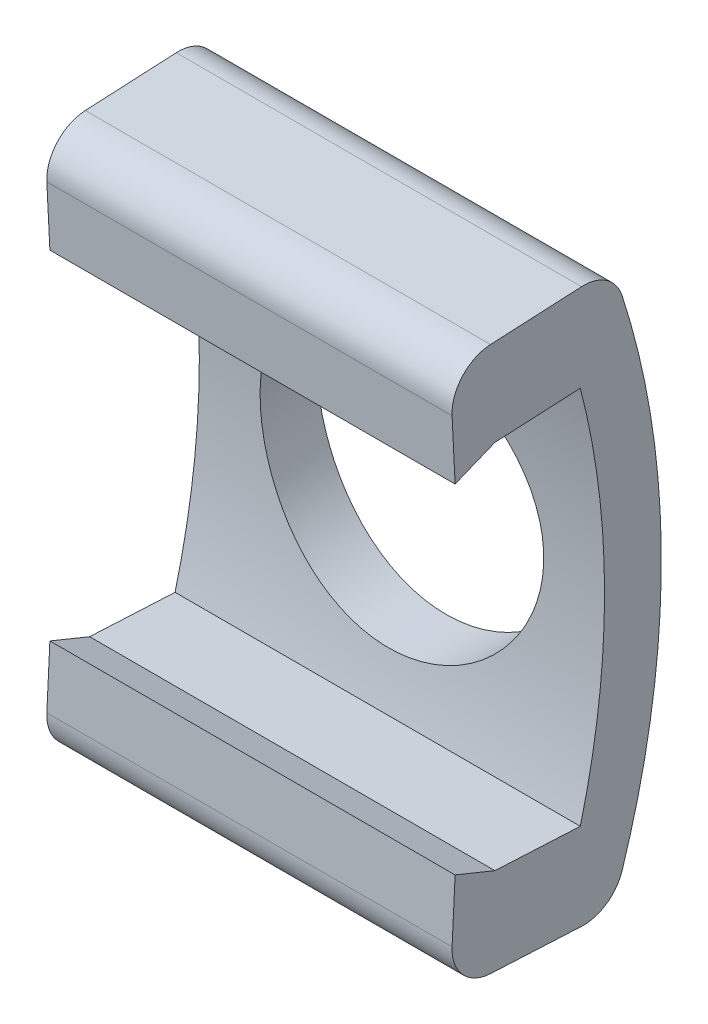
ISO-10303-21;
HEADER;
FILE_DESCRIPTION(('STEP AP214'),'2;1');
FILE_NAME('part.step','',(''),(''),'','','');
FILE_SCHEMA(('AUTOMOTIVE_DESIGN { 1 0 10303 214 1 1 1 1 }'));
ENDSEC;
DATA;
#1=APPLICATION_CONTEXT('core data for automotive mechanical design processes');
#2=APPLICATION_PROTOCOL_DEFINITION('international standard','automotive_design',2000,#1);
#3=PRODUCT_CONTEXT('',#1,'mechanical');
#4=PRODUCT('Part','Part','',(#3));
#5=PRODUCT_RELATED_PRODUCT_CATEGORY('part','',(#4));
#6=PRODUCT_DEFINITION_FORMATION('','',#4);
#7=PRODUCT_DEFINITION_CONTEXT('part definition',#1,'design');
#8=PRODUCT_DEFINITION('design','',#6,#7);
#9=PRODUCT_DEFINITION_SHAPE('','',#8);
#10=(LENGTH_UNIT() NAMED_UNIT(*) SI_UNIT(.MILLI.,.METRE.));
#11=(NAMED_UNIT(*) PLANE_ANGLE_UNIT() SI_UNIT($,.RADIAN.));
#12=(NAMED_UNIT(*) SI_UNIT($,.STERADIAN.) SOLID_ANGLE_UNIT());
#13=UNCERTAINTY_MEASURE_WITH_UNIT(LENGTH_MEASURE(1.E-05),#10,'distance_accuracy_value','');
#14=(GEOMETRIC_REPRESENTATION_CONTEXT(3) GLOBAL_UNCERTAINTY_ASSIGNED_CONTEXT((#13)) GLOBAL_UNIT_ASSIGNED_CONTEXT((#10,
#11,#12)) REPRESENTATION_CONTEXT('',''));
#15=CARTESIAN_POINT('',(0.,0.,0.));
#16=DIRECTION('',(0.,0.,1.));
#17=DIRECTION('',(1.,0.,0.));
#18=AXIS2_PLACEMENT_3D('',#15,#16,#17);
#19=CARTESIAN_POINT('',(5.,0.,20.));
#20=DIRECTION('',(-1.,0.,0.));
#21=DIRECTION('',(0.,0.,1.));
#22=AXIS2_PLACEMENT_3D('',#19,#20,#21);
#23=CYLINDRICAL_SURFACE('',#22,18.6);
#24=CARTESIAN_POINT('',(-5.,0.,20.));
#25=DIRECTION('',(-1.,0.,0.));
#26=DIRECTION('',(0.,0.,-1.));
#27=AXIS2_PLACEMENT_3D('',#24,#25,#26);
#28=CIRCLE('',#27,18.6);
#29=CARTESIAN_POINT('',(-5.,4.68126724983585,1.99872957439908));
#30=VERTEX_POINT('',#29);
#31=CARTESIAN_POINT('',(-5.,-4.68126724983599,1.99872957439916));
#32=VERTEX_POINT('',#31);
#33=EDGE_CURVE('E188',#30,#32,#28,.T.);
#34=ORIENTED_EDGE('',*,*,#33,.T.);
#35=DIRECTION('',(-1.,0.,0.));
#36=VECTOR('',#35,1.);
#37=CARTESIAN_POINT('',(5.,-4.68126724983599,1.99872957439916));
#38=LINE('',#37,#36);
#39=CARTESIAN_POINT('',(5.,-4.68126724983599,1.99872957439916));
#40=VERTEX_POINT('',#39);
#41=EDGE_CURVE('E243',#40,#32,#38,.T.);
#42=ORIENTED_EDGE('',*,*,#41,.F.);
#43=CARTESIAN_POINT('',(5.,0.,20.));
#44=DIRECTION('',(-1.,0.,0.));
#45=DIRECTION('',(0.,0.,-1.));
#46=AXIS2_PLACEMENT_3D('',#43,#44,#45);
#47=CIRCLE('',#46,18.6);
#48=CARTESIAN_POINT('',(5.,4.68126724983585,1.99872957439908));
#49=VERTEX_POINT('',#48);
#50=EDGE_CURVE('E268',#49,#40,#47,.T.);
#51=ORIENTED_EDGE('',*,*,#50,.F.);
#52=DIRECTION('',(-1.,0.,0.));
#53=VECTOR('',#52,1.);
#54=CARTESIAN_POINT('',(5.,4.68126724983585,1.99872957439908));
#55=LINE('',#54,#53);
#56=EDGE_CURVE('E246',#49,#30,#55,.T.);
#57=ORIENTED_EDGE('',*,*,#56,.T.);
#58=EDGE_LOOP('',(#34,#42,#51,#57));
#59=FACE_BOUND('',#58,.T.);
#60=CARTESIAN_POINT('',(-3.5,0.,1.40000000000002));
#61=CARTESIAN_POINT('',(-3.49999257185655,-0.194754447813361,1.40000353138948));
#62=CARTESIAN_POINT('',(-3.48368965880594,-0.389605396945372,1.40309038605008));
#63=CARTESIAN_POINT('',(-3.41895125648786,-0.773815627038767,1.41510691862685));
#64=CARTESIAN_POINT('',(-3.37048873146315,-0.963170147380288,1.42404151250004));
#65=CARTESIAN_POINT('',(-3.24296825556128,-1.33077552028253,1.44675416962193));
#66=CARTESIAN_POINT('',(-3.16393802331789,-1.5090362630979,1.4605278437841));
#67=CARTESIAN_POINT('',(-2.9776043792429,-1.84975174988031,1.49141494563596));
#68=CARTESIAN_POINT('',(-2.87030322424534,-2.01220775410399,1.50852810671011));
#69=CARTESIAN_POINT('',(-2.62910031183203,-2.31867726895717,1.54443630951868));
#70=CARTESIAN_POINT('',(-2.4949237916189,-2.46247265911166,1.56324751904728));
#71=CARTESIAN_POINT('',(-2.20436995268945,-2.72565207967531,1.60031180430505));
#72=CARTESIAN_POINT('',(-2.04799103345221,-2.84503434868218,1.61856483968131));
#73=CARTESIAN_POINT('',(-1.71592852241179,-3.05690702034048,1.65260330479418));
#74=CARTESIAN_POINT('',(-1.54010090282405,-3.14917533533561,1.66836789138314));
#75=CARTESIAN_POINT('',(-1.17509395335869,-3.30277916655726,1.69541664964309));
#76=CARTESIAN_POINT('',(-0.985915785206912,-3.36411737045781,1.70670121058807));
#77=CARTESIAN_POINT('',(-0.601912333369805,-3.45341937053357,1.72334947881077));
#78=CARTESIAN_POINT('',(-0.407178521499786,-3.48176367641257,1.72878063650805));
#79=CARTESIAN_POINT('',(-0.0156493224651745,-3.50545441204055,1.73331050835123));
#80=CARTESIAN_POINT('',(0.18114587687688,-3.50080382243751,1.7324097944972));
#81=CARTESIAN_POINT('',(0.568453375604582,-3.4589452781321,1.72443909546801));
#82=CARTESIAN_POINT('',(0.759014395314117,-3.42217019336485,1.71745113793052));
#83=CARTESIAN_POINT('',(1.13121277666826,-3.31778835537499,1.69822217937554));
#84=CARTESIAN_POINT('',(1.31284975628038,-3.25018028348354,1.68598095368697));
#85=CARTESIAN_POINT('',(1.66330960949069,-3.08562880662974,1.65753908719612));
#86=CARTESIAN_POINT('',(1.83204851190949,-2.98851078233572,1.64131499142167));
#87=CARTESIAN_POINT('',(2.1509979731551,-2.76781970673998,1.6067509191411));
#88=CARTESIAN_POINT('',(2.30120663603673,-2.64424395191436,1.58841072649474));
#89=CARTESIAN_POINT('',(2.58133257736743,-2.37181228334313,1.55132363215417));
#90=CARTESIAN_POINT('',(2.71088984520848,-2.22258616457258,1.53257489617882));
#91=CARTESIAN_POINT('',(2.94318645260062,-1.90432808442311,1.49705076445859));
#92=CARTESIAN_POINT('',(3.04592551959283,-1.73529592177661,1.48027538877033));
#93=CARTESIAN_POINT('',(3.22172309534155,-1.38184714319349,1.45055387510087));
#94=CARTESIAN_POINT('',(3.29474396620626,-1.19741137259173,1.43761259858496));
#95=CARTESIAN_POINT('',(3.40866732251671,-0.818593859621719,1.41705495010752));
#96=CARTESIAN_POINT('',(3.4495732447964,-0.624213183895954,1.40943800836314));
#97=CARTESIAN_POINT('',(3.49760398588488,-0.234120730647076,1.4004655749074));
#98=CARTESIAN_POINT('',(3.50522204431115,-0.0384717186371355,1.39901866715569));
#99=CARTESIAN_POINT('',(3.4877841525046,0.351304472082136,1.40229673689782));
#100=CARTESIAN_POINT('',(3.46272981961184,0.545431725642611,1.40702140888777));
#101=CARTESIAN_POINT('',(3.38106840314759,0.925087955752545,1.42205482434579));
#102=CARTESIAN_POINT('',(3.32471108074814,1.11067255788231,1.43231934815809));
#103=CARTESIAN_POINT('',(3.1823138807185,1.46975883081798,1.45728623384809));
#104=CARTESIAN_POINT('',(3.09627197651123,1.64325967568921,1.47198889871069));
#105=CARTESIAN_POINT('',(2.89585762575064,1.97535709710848,1.5044292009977));
#106=CARTESIAN_POINT('',(2.781184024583,2.13376878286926,1.52219843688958));
#107=CARTESIAN_POINT('',(2.5271687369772,2.4292774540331,1.55871965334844));
#108=CARTESIAN_POINT('',(2.38782472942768,2.5663724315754,1.57747172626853));
#109=CARTESIAN_POINT('',(2.08619046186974,2.81723181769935,1.61414866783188));
#110=CARTESIAN_POINT('',(1.92361812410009,2.93065951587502,1.63205911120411));
#111=CARTESIAN_POINT('',(1.58143745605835,3.12859665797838,1.66473374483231));
#112=CARTESIAN_POINT('',(1.40182976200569,3.21310718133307,1.67949805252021));
#113=CARTESIAN_POINT('',(1.03152862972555,3.35033459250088,1.70409535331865));
#114=CARTESIAN_POINT('',(0.840893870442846,3.40320535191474,1.71395217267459));
#115=CARTESIAN_POINT('',(0.45324393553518,3.47612654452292,1.72767268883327));
#116=CARTESIAN_POINT('',(0.256229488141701,3.49618071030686,1.73153706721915));
#117=CARTESIAN_POINT('',(-0.135214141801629,3.50277386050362,1.73280042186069));
#118=CARTESIAN_POINT('',(-0.329634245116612,3.48984402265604,1.73030186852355));
#119=CARTESIAN_POINT('',(-0.713476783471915,3.43199961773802,1.71934819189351));
#120=CARTESIAN_POINT('',(-0.902899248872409,3.387085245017,1.71089310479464));
#121=CARTESIAN_POINT('',(-1.27108103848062,3.26677151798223,1.6890223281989));
#122=CARTESIAN_POINT('',(-1.44985988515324,3.19143008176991,1.6756160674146));
#123=CARTESIAN_POINT('',(-1.79232432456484,3.01245914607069,1.64534688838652));
#124=CARTESIAN_POINT('',(-1.95600883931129,2.90882762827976,1.62848372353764));
#125=CARTESIAN_POINT('',(-2.2662981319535,2.67437327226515,1.59288294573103));
#126=CARTESIAN_POINT('',(-2.41260818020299,2.54316401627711,1.5741209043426));
#127=CARTESIAN_POINT('',(-2.68131144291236,2.2580840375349,1.53701875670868));
#128=CARTESIAN_POINT('',(-2.80369915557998,2.10420811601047,1.51867874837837));
#129=CARTESIAN_POINT('',(-3.02212205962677,1.77648904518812,1.48429175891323));
#130=CARTESIAN_POINT('',(-3.11790794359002,1.60247731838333,1.46826710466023));
#131=CARTESIAN_POINT('',(-3.27873167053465,1.24058472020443,1.44053449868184));
#132=CARTESIAN_POINT('',(-3.34379833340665,1.05271704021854,1.42882250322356));
#133=CARTESIAN_POINT('',(-3.42815731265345,0.72025330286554,1.41341671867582));
#134=CARTESIAN_POINT('',(-3.45505217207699,0.577598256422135,1.40841391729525));
#135=CARTESIAN_POINT('',(-3.49097605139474,0.289979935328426,1.40170428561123));
#136=CARTESIAN_POINT('',(-3.50000553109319,0.145016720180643,1.39999737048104));
#137=CARTESIAN_POINT('',(-3.5,0.,1.40000000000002));
#138=B_SPLINE_CURVE_WITH_KNOTS('',3,(#60,#61,#62,#63,#64,#65,#66,#67,#68,#69,#70,#71,#72,#73,
#74,#75,#76,#77,#78,#79,#80,#81,#82,#83,#84,#85,#86,#87,#88,#89,#90,#91,#92,#93,#94,#95,#96,#97,
#98,#99,#100,#101,#102,#103,#104,#105,#106,#107,#108,#109,#110,#111,#112,#113,#114,#115,#116,
#117,#118,#119,#120,#121,#122,#123,#124,#125,#126,#127,#128,#129,#130,#131,#132,#133,#134,#135,
#136,#137),.UNSPECIFIED.,.T.,.F.,(4,2,2,2,2,2,2,2,2,2,2,2,2,2,2,2,2,2,2,2,2,2,2,2,2,2,2,2,2,2,2,
2,2,2,2,2,2,2,4),(0.,0.583732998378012,1.16795734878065,1.75165316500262,2.33530239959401,
2.92525485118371,3.5152498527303,4.10995072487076,4.70459991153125,5.29232101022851,
5.87998901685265,6.45985840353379,7.03975259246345,7.6231473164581,8.20660168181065,
8.79931908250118,9.3920425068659,9.98551429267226,10.5789225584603,11.163507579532,
11.7480636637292,12.3280213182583,12.9080185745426,13.4943942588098,14.0808251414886,
14.6751025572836,15.2693577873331,15.8606990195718,16.4519729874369,17.0337853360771,
17.6155941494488,18.1963006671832,18.7770486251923,19.366552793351,19.9561923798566,
20.551184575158,21.1456174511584,21.5802838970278,22.0149391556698),.UNSPECIFIED.);
#139=CARTESIAN_POINT('',(-3.5,0.,1.40000000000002));
#140=VERTEX_POINT('',#139);
#141=EDGE_CURVE('E185',#140,#140,#138,.T.);
#142=ORIENTED_EDGE('',*,*,#141,.F.);
#143=EDGE_LOOP('',(#142));
#144=FACE_BOUND('',#143,.T.);
#145=ADVANCED_FACE('F37',(#59,#144),#23,.F.);
#146=CARTESIAN_POINT('',(5.,0.,20.));
#147=DIRECTION('',(-1.,0.,0.));
#148=DIRECTION('',(0.,0.,1.));
#149=AXIS2_PLACEMENT_3D('',#146,#147,#148);
#150=CYLINDRICAL_SURFACE('',#149,20.);
#151=CARTESIAN_POINT('',(-5.,0.,20.));
#152=DIRECTION('',(1.,0.,0.));
#153=DIRECTION('',(0.,0.,-1.));
#154=AXIS2_PLACEMENT_3D('',#151,#152,#153);
#155=CIRCLE('',#154,20.);
#156=CARTESIAN_POINT('',(-5.,-6.143921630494,0.96707518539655));
#157=VERTEX_POINT('',#156);
#158=CARTESIAN_POINT('',(-5.,6.14392163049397,0.967075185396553));
#159=VERTEX_POINT('',#158);
#160=EDGE_CURVE('E203',#157,#159,#155,.T.);
#161=ORIENTED_EDGE('',*,*,#160,.T.);
#162=DIRECTION('',(-1.,0.,0.));
#163=VECTOR('',#162,1.);
#164=CARTESIAN_POINT('',(5.,6.14392163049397,0.967075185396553));
#165=LINE('',#164,#163);
#166=CARTESIAN_POINT('',(5.,6.14392163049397,0.967075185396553));
#167=VERTEX_POINT('',#166);
#168=EDGE_CURVE('E218',#167,#159,#165,.T.);
#169=ORIENTED_EDGE('',*,*,#168,.F.);
#170=CARTESIAN_POINT('',(5.,0.,20.));
#171=DIRECTION('',(1.,0.,0.));
#172=DIRECTION('',(0.,0.,-1.));
#173=AXIS2_PLACEMENT_3D('',#170,#171,#172);
#174=CIRCLE('',#173,20.);
#175=CARTESIAN_POINT('',(5.,-6.143921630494,0.96707518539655));
#176=VERTEX_POINT('',#175);
#177=EDGE_CURVE('E283',#176,#167,#174,.T.);
#178=ORIENTED_EDGE('',*,*,#177,.F.);
#179=DIRECTION('',(-1.,0.,0.));
#180=VECTOR('',#179,1.);
#181=CARTESIAN_POINT('',(5.,-6.143921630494,0.96707518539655));
#182=LINE('',#181,#180);
#183=EDGE_CURVE('E222',#176,#157,#182,.T.);
#184=ORIENTED_EDGE('',*,*,#183,.T.);
#185=EDGE_LOOP('',(#161,#169,#178,#184));
#186=FACE_BOUND('',#185,.T.);
#187=CARTESIAN_POINT('',(-3.5,0.,0.));
#188=CARTESIAN_POINT('',(-3.49999231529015,0.195000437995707,3.42898014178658E-06));
#189=CARTESIAN_POINT('',(-3.48364843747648,0.390103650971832,0.00288149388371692));
#190=CARTESIAN_POINT('',(-3.41873769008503,0.774828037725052,0.0140854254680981));
#191=CARTESIAN_POINT('',(-3.37014213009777,0.96444417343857,0.0224161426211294));
#192=CARTESIAN_POINT('',(-3.24224852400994,1.33257343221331,0.043591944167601));
#193=CARTESIAN_POINT('',(-3.16297660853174,1.51109585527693,0.0564331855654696));
#194=CARTESIAN_POINT('',(-2.97605123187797,1.85228595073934,0.0852218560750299));
#195=CARTESIAN_POINT('',(-2.86840064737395,2.01495522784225,0.101168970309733));
#196=CARTESIAN_POINT('',(-2.62657278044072,2.32154916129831,0.134591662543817));
#197=CARTESIAN_POINT('',(-2.49215572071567,2.46528329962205,0.15208019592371));
#198=CARTESIAN_POINT('',(-2.20112652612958,2.72828019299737,0.186516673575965));
#199=CARTESIAN_POINT('',(-2.04451291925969,2.847541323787,0.203464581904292));
#200=CARTESIAN_POINT('',(-1.71221287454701,3.05898159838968,0.235026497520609));
#201=CARTESIAN_POINT('',(-1.53640349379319,3.15097024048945,0.249623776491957));
#202=CARTESIAN_POINT('',(-1.17152921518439,3.30403560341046,0.274650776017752));
#203=CARTESIAN_POINT('',(-0.982465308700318,3.36511463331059,0.285080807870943));
#204=CARTESIAN_POINT('',(-0.598475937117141,3.4540223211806,0.300462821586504));
#205=CARTESIAN_POINT('',(-0.403629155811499,3.48218122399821,0.305469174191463));
#206=CARTESIAN_POINT('',(-0.0119170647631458,3.50547370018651,0.30960123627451));
#207=CARTESIAN_POINT('',(0.184948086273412,3.50060985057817,0.308727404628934));
#208=CARTESIAN_POINT('',(0.572737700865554,3.45826341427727,0.301247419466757));
#209=CARTESIAN_POINT('',(0.763704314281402,3.42115355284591,0.294706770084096));
#210=CARTESIAN_POINT('',(1.13665846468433,3.3159542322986,0.276732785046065));
#211=CARTESIAN_POINT('',(1.31864566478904,3.24786361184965,0.265299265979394));
#212=CARTESIAN_POINT('',(1.66958108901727,3.0822629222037,0.238757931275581));
#213=CARTESIAN_POINT('',(1.83845555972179,2.98459973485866,0.223631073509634));
#214=CARTESIAN_POINT('',(2.15756073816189,2.76273475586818,0.191420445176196));
#215=CARTESIAN_POINT('',(2.30778978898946,2.63853060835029,0.174336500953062));
#216=CARTESIAN_POINT('',(2.58749566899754,2.36508680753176,0.139849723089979));
#217=CARTESIAN_POINT('',(2.71666029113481,2.21552773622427,0.122445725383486));
#218=CARTESIAN_POINT('',(2.94810988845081,1.89669536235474,0.0894954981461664));
#219=CARTESIAN_POINT('',(3.05039465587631,1.72742190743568,0.0739492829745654));
#220=CARTESIAN_POINT('',(3.22521621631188,1.37365987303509,0.0464407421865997));
#221=CARTESIAN_POINT('',(3.29772354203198,1.18915643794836,0.0344819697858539));
#222=CARTESIAN_POINT('',(3.41063229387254,0.810333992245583,0.015523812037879));
#223=CARTESIAN_POINT('',(3.45103668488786,0.616015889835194,0.00852396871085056));
#224=CARTESIAN_POINT('',(3.4981650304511,0.225769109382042,0.00033445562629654));
#225=CARTESIAN_POINT('',(3.50531725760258,0.0298936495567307,-0.000929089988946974));
#226=CARTESIAN_POINT('',(3.48688274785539,-0.360255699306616,0.00229335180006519));
#227=CARTESIAN_POINT('',(3.46129740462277,-0.554529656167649,0.00677909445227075));
#228=CARTESIAN_POINT('',(3.37847021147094,-0.934624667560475,0.0209502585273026));
#229=CARTESIAN_POINT('',(3.32144220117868,-1.12049374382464,0.0306005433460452));
#230=CARTESIAN_POINT('',(3.17757777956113,-1.48003298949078,0.0540232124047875));
#231=CARTESIAN_POINT('',(3.090739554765,-1.65370241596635,0.0677958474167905));
#232=CARTESIAN_POINT('',(2.88875162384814,-1.98576028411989,0.0981193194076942));
#233=CARTESIAN_POINT('',(2.77333664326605,-2.14398498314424,0.114695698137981));
#234=CARTESIAN_POINT('',(2.51783399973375,-2.43897402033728,0.148715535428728));
#235=CARTESIAN_POINT('',(2.37774434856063,-2.57573662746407,0.166159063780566));
#236=CARTESIAN_POINT('',(2.0749410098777,-2.82552229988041,0.200188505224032));
#237=CARTESIAN_POINT('',(1.91198608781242,-2.93825484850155,0.216762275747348));
#238=CARTESIAN_POINT('',(1.56920033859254,-3.13474614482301,0.246942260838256));
#239=CARTESIAN_POINT('',(1.38937008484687,-3.21850587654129,0.26054857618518));
#240=CARTESIAN_POINT('',(1.0187217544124,-3.35424807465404,0.283160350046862));
#241=CARTESIAN_POINT('',(0.82795630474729,-3.40637071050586,0.292186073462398));
#242=CARTESIAN_POINT('',(0.440205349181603,-3.4777970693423,0.304663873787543));
#243=CARTESIAN_POINT('',(0.243220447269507,-3.49710396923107,0.308116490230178));
#244=CARTESIAN_POINT('',(-0.148473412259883,-3.50225530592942,0.309032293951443));
#245=CARTESIAN_POINT('',(-0.343176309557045,-3.48855737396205,0.306577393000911));
#246=CARTESIAN_POINT('',(-0.727460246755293,-3.42908220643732,0.296135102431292));
#247=CARTESIAN_POINT('',(-0.917041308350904,-3.3833051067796,0.288147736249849));
#248=CARTESIAN_POINT('',(-1.28549628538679,-3.26115335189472,0.267572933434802));
#249=CARTESIAN_POINT('',(-1.46438495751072,-3.18482204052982,0.254992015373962));
#250=CARTESIAN_POINT('',(-1.8068908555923,-3.00377671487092,0.226642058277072));
#251=CARTESIAN_POINT('',(-1.97050719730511,-2.89906105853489,0.210872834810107));
#252=CARTESIAN_POINT('',(-2.28012857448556,-2.66260253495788,0.177665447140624));
#253=CARTESIAN_POINT('',(-2.42587551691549,-2.53052435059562,0.160208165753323));
#254=CARTESIAN_POINT('',(-2.69329240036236,-2.24379443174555,0.125740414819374));
#255=CARTESIAN_POINT('',(-2.81495679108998,-2.08913750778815,0.108730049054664));
#256=CARTESIAN_POINT('',(-3.0316188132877,-1.76022037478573,0.0769202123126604));
#257=CARTESIAN_POINT('',(-3.12640399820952,-1.58581845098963,0.062138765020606));
#258=CARTESIAN_POINT('',(-3.28518255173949,-1.22337325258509,0.0366276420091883));
#259=CARTESIAN_POINT('',(-3.34920591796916,-1.03534347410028,0.0258940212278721));
#260=CARTESIAN_POINT('',(-3.43109116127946,-0.705540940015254,0.0119711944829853));
#261=CARTESIAN_POINT('',(-3.45688953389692,-0.565738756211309,0.00750651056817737));
#262=CARTESIAN_POINT('',(-3.49134657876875,-0.283975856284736,0.00151969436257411));
#263=CARTESIAN_POINT('',(-3.50000559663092,-0.142015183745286,-2.49726231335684E-06));
#264=CARTESIAN_POINT('',(-3.5,0.,0.));
#265=B_SPLINE_CURVE_WITH_KNOTS('',3,(#187,#188,#189,#190,#191,#192,#193,#194,#195,#196,#197,
#198,#199,#200,#201,#202,#203,#204,#205,#206,#207,#208,#209,#210,#211,#212,#213,#214,#215,#216,
#217,#218,#219,#220,#221,#222,#223,#224,#225,#226,#227,#228,#229,#230,#231,#232,#233,#234,#235,
#236,#237,#238,#239,#240,#241,#242,#243,#244,#245,#246,#247,#248,#249,#250,#251,#252,#253,#254,
#255,#256,#257,#258,#259,#260,#261,#262,#263,#264),.UNSPECIFIED.,.T.,.F.,(4,2,2,2,2,2,2,2,2,2,2,
2,2,2,2,2,2,2,2,2,2,2,2,2,2,2,2,2,2,2,2,2,2,2,2,2,2,2,4),(0.,0.584482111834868,1.16948486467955,
1.75399039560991,2.33843669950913,2.92837532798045,3.51835309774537,4.11235976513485,
4.70632205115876,5.29427331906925,5.88217870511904,6.46337766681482,7.04459841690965,
7.62888156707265,8.21321660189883,8.8055500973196,9.39788817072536,9.99081100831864,
10.5836790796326,11.1688897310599,11.7540754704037,12.3353296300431,12.916619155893,
13.5035215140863,14.0904711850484,14.684158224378,15.2778250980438,15.868842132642,
16.4598019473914,17.042615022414,17.6254256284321,18.2074123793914,18.7894328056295,
19.3790592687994,19.9688214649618,20.5631227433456,21.1568433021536,21.5825193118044,
22.0081867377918),.UNSPECIFIED.);
#266=CARTESIAN_POINT('',(-3.5,0.,0.));
#267=VERTEX_POINT('',#266);
#268=EDGE_CURVE('E11',#267,#267,#265,.T.);
#269=ORIENTED_EDGE('',*,*,#268,.F.);
#270=EDGE_LOOP('',(#269));
#271=FACE_BOUND('',#270,.T.);
#272=ADVANCED_FACE('F289',(#186,#271),#150,.T.);
#273=CARTESIAN_POINT('',(5.,4.57555134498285,4.10652189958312));
#274=DIRECTION('',(0.,0.926125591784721,0.377215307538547));
#275=DIRECTION('',(0.,-0.377215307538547,0.926125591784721));
#276=AXIS2_PLACEMENT_3D('',#273,#274,#275);
#277=PLANE('',#276);
#278=DIRECTION('',(0.,0.377215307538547,-0.926125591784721));
#279=VECTOR('',#278,1.);
#280=CARTESIAN_POINT('',(-5.,4.57555134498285,4.10652189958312));
#281=LINE('',#280,#279);
#282=CARTESIAN_POINT('',(-5.,4.17589889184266,5.08773437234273));
#283=VERTEX_POINT('',#282);
#284=CARTESIAN_POINT('',(-5.,4.57555134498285,4.10652189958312));
#285=VERTEX_POINT('',#284);
#286=EDGE_CURVE('E181',#283,#285,#281,.T.);
#287=ORIENTED_EDGE('',*,*,#286,.T.);
#288=DIRECTION('',(-1.,0.,0.));
#289=VECTOR('',#288,1.);
#290=CARTESIAN_POINT('',(5.,4.57555134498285,4.10652189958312));
#291=LINE('',#290,#289);
#292=CARTESIAN_POINT('',(5.,4.57555134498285,4.10652189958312));
#293=VERTEX_POINT('',#292);
#294=EDGE_CURVE('E51',#293,#285,#291,.T.);
#295=ORIENTED_EDGE('',*,*,#294,.F.);
#296=DIRECTION('',(0.,0.377215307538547,-0.926125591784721));
#297=VECTOR('',#296,1.);
#298=CARTESIAN_POINT('',(5.,4.57555134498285,4.10652189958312));
#299=LINE('',#298,#297);
#300=CARTESIAN_POINT('',(5.,4.17589889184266,5.08773437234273));
#301=VERTEX_POINT('',#300);
#302=EDGE_CURVE('E212',#301,#293,#299,.T.);
#303=ORIENTED_EDGE('',*,*,#302,.F.);
#304=DIRECTION('',(-1.,0.,0.));
#305=VECTOR('',#304,1.);
#306=CARTESIAN_POINT('',(5.,4.17589889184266,5.08773437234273));
#307=LINE('',#306,#305);
#308=EDGE_CURVE('E177',#301,#283,#307,.T.);
#309=ORIENTED_EDGE('',*,*,#308,.T.);
#310=EDGE_LOOP('',(#287,#295,#303,#309));
#311=FACE_BOUND('',#310,.T.);
#312=ADVANCED_FACE('F39',(#311),#277,.F.);
#313=CARTESIAN_POINT('',(5.,4.68126724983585,1.99872957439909));
#314=DIRECTION('',(0.,0.998744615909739,0.0500918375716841));
#315=DIRECTION('',(0.,-0.0500918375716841,0.998744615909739));
#316=AXIS2_PLACEMENT_3D('',#313,#314,#315);
#317=PLANE('',#316);
#318=DIRECTION('',(0.,0.0500918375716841,-0.998744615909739));
#319=VECTOR('',#318,1.);
#320=CARTESIAN_POINT('',(-5.,4.68126724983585,1.99872957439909));
#321=LINE('',#320,#319);
#322=EDGE_CURVE('E184',#285,#30,#321,.T.);
#323=ORIENTED_EDGE('',*,*,#322,.T.);
#324=ORIENTED_EDGE('',*,*,#56,.F.);
#325=DIRECTION('',(0.,0.0500918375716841,-0.998744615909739));
#326=VECTOR('',#325,1.);
#327=CARTESIAN_POINT('',(5.,4.68126724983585,1.99872957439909));
#328=LINE('',#327,#326);
#329=EDGE_CURVE('E121',#293,#49,#328,.T.);
#330=ORIENTED_EDGE('',*,*,#329,.F.);
#331=ORIENTED_EDGE('',*,*,#294,.T.);
#332=EDGE_LOOP('',(#323,#324,#330,#331));
#333=FACE_BOUND('',#332,.T.);
#334=ADVANCED_FACE('F249',(#333),#317,.F.);
#335=CARTESIAN_POINT('',(5.,-4.68126724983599,1.99872957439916));
#336=DIRECTION('',(0.,-0.998744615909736,0.0500918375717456));
#337=DIRECTION('',(0.,-0.0500918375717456,-0.998744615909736));
#338=AXIS2_PLACEMENT_3D('',#335,#336,#337);
#339=PLANE('',#338);
#340=DIRECTION('',(0.,0.0500918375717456,0.998744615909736));
#341=VECTOR('',#340,1.);
#342=CARTESIAN_POINT('',(-5.,-4.68126724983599,1.99872957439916));
#343=LINE('',#342,#341);
#344=CARTESIAN_POINT('',(-5.,-4.57555134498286,4.10652189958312));
#345=VERTEX_POINT('',#344);
#346=EDGE_CURVE('E190',#32,#345,#343,.T.);
#347=ORIENTED_EDGE('',*,*,#346,.T.);
#348=DIRECTION('',(-1.,0.,0.));
#349=VECTOR('',#348,1.);
#350=CARTESIAN_POINT('',(5.,-4.57555134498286,4.10652189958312));
#351=LINE('',#350,#349);
#352=CARTESIAN_POINT('',(5.,-4.57555134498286,4.10652189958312));
#353=VERTEX_POINT('',#352);
#354=EDGE_CURVE('E240',#353,#345,#351,.T.);
#355=ORIENTED_EDGE('',*,*,#354,.F.);
#356=DIRECTION('',(0.,0.0500918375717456,0.998744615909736));
#357=VECTOR('',#356,1.);
#358=CARTESIAN_POINT('',(5.,-4.68126724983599,1.99872957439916));
#359=LINE('',#358,#357);
#360=EDGE_CURVE('E265',#40,#353,#359,.T.);
#361=ORIENTED_EDGE('',*,*,#360,.F.);
#362=ORIENTED_EDGE('',*,*,#41,.T.);
#363=EDGE_LOOP('',(#347,#355,#361,#362));
#364=FACE_BOUND('',#363,.T.);
#365=ADVANCED_FACE('F263',(#364),#339,.F.);
#366=CARTESIAN_POINT('',(5.,-4.57555134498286,4.10652189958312));
#367=DIRECTION('',(0.,-0.926125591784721,0.377215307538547));
#368=DIRECTION('',(0.,-0.377215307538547,-0.926125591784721));
#369=AXIS2_PLACEMENT_3D('',#366,#367,#368);
#370=PLANE('',#369);
#371=DIRECTION('',(0.,0.377215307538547,0.926125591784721));
#372=VECTOR('',#371,1.);
#373=CARTESIAN_POINT('',(-5.,-4.57555134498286,4.10652189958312));
#374=LINE('',#373,#372);
#375=CARTESIAN_POINT('',(-5.,-4.17589889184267,5.08773437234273));
#376=VERTEX_POINT('',#375);
#377=EDGE_CURVE('E192',#345,#376,#374,.T.);
#378=ORIENTED_EDGE('',*,*,#377,.T.);
#379=DIRECTION('',(-1.,0.,0.));
#380=VECTOR('',#379,1.);
#381=CARTESIAN_POINT('',(5.,-4.17589889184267,5.08773437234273));
#382=LINE('',#381,#380);
#383=CARTESIAN_POINT('',(5.,-4.17589889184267,5.08773437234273));
#384=VERTEX_POINT('',#383);
#385=EDGE_CURVE('E237',#384,#376,#382,.T.);
#386=ORIENTED_EDGE('',*,*,#385,.F.);
#387=DIRECTION('',(0.,0.377215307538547,0.926125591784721));
#388=VECTOR('',#387,1.);
#389=CARTESIAN_POINT('',(5.,-4.57555134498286,4.10652189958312));
#390=LINE('',#389,#388);
#391=EDGE_CURVE('E267',#353,#384,#390,.T.);
#392=ORIENTED_EDGE('',*,*,#391,.F.);
#393=ORIENTED_EDGE('',*,*,#354,.T.);
#394=EDGE_LOOP('',(#378,#386,#392,#393));
#395=FACE_BOUND('',#394,.T.);
#396=ADVANCED_FACE('F314',(#395),#370,.F.);
#397=CARTESIAN_POINT('',(5.,-4.17589889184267,5.08773437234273));
#398=DIRECTION('',(0.,-0.0500918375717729,-0.998744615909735));
#399=DIRECTION('',(0.,0.998744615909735,-0.0500918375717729));
#400=AXIS2_PLACEMENT_3D('',#397,#398,#399);
#401=PLANE('',#400);
#402=DIRECTION('',(0.,-0.998744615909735,0.0500918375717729));
#403=VECTOR('',#402,1.);
#404=CARTESIAN_POINT('',(-5.,-4.17589889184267,5.08773437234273));
#405=LINE('',#404,#403);
#406=CARTESIAN_POINT('',(-5.,-5.67401581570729,5.16287212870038));
#407=VERTEX_POINT('',#406);
#408=EDGE_CURVE('E194',#376,#407,#405,.T.);
#409=ORIENTED_EDGE('',*,*,#408,.T.);
#410=DIRECTION('',(-1.,0.,0.));
#411=VECTOR('',#410,1.);
#412=CARTESIAN_POINT('',(5.,-5.67401581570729,5.16287212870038));
#413=LINE('',#412,#411);
#414=CARTESIAN_POINT('',(5.,-5.67401581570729,5.16287212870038));
#415=VERTEX_POINT('',#414);
#416=EDGE_CURVE('E234',#415,#407,#413,.T.);
#417=ORIENTED_EDGE('',*,*,#416,.F.);
#418=DIRECTION('',(0.,-0.998744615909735,0.0500918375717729));
#419=VECTOR('',#418,1.);
#420=CARTESIAN_POINT('',(5.,-4.17589889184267,5.08773437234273));
#421=LINE('',#420,#419);
#422=EDGE_CURVE('E270',#384,#415,#421,.T.);
#423=ORIENTED_EDGE('',*,*,#422,.F.);
#424=ORIENTED_EDGE('',*,*,#385,.T.);
#425=EDGE_LOOP('',(#409,#417,#423,#424));
#426=FACE_BOUND('',#425,.T.);
#427=ADVANCED_FACE('F311',(#426),#401,.F.);
#428=CARTESIAN_POINT('',(5.,-5.72410765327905,4.16412751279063));
#429=DIRECTION('',(-1.,0.,0.));
#430=DIRECTION('',(0.,0.,1.));
#431=AXIS2_PLACEMENT_3D('',#428,#429,#430);
#432=CYLINDRICAL_SURFACE('',#431,1.00000000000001);
#433=CARTESIAN_POINT('',(-5.,-5.72410765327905,4.16412751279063));
#434=DIRECTION('',(1.,0.,0.));
#435=DIRECTION('',(0.,0.,-1.));
#436=AXIS2_PLACEMENT_3D('',#433,#434,#435);
#437=CIRCLE('',#436,1.00000000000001);
#438=CARTESIAN_POINT('',(-5.,-6.72285226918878,4.2142193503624));
#439=VERTEX_POINT('',#438);
#440=EDGE_CURVE('E196',#407,#439,#437,.T.);
#441=ORIENTED_EDGE('',*,*,#440,.T.);
#442=DIRECTION('',(-1.,0.,0.));
#443=VECTOR('',#442,1.);
#444=CARTESIAN_POINT('',(5.,-6.72285226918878,4.2142193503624));
#445=LINE('',#444,#443);
#446=CARTESIAN_POINT('',(5.,-6.72285226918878,4.2142193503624));
#447=VERTEX_POINT('',#446);
#448=EDGE_CURVE('E230',#447,#439,#445,.T.);
#449=ORIENTED_EDGE('',*,*,#448,.F.);
#450=CARTESIAN_POINT('',(5.,-5.72410765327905,4.16412751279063));
#451=DIRECTION('',(1.,0.,0.));
#452=DIRECTION('',(0.,0.,-1.));
#453=AXIS2_PLACEMENT_3D('',#450,#451,#452);
#454=CIRCLE('',#453,1.00000000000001);
#455=EDGE_CURVE('E276',#415,#447,#454,.T.);
#456=ORIENTED_EDGE('',*,*,#455,.F.);
#457=ORIENTED_EDGE('',*,*,#416,.T.);
#458=EDGE_LOOP('',(#441,#449,#456,#457));
#459=FACE_BOUND('',#458,.T.);
#460=ADVANCED_FACE('F306',(#459),#432,.T.);
#461=CARTESIAN_POINT('',(5.,-6.83547016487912,1.96881326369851));
#462=DIRECTION('',(0.,0.998744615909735,-0.0500918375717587));
#463=DIRECTION('',(0.,0.0500918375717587,0.998744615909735));
#464=AXIS2_PLACEMENT_3D('',#461,#462,#463);
#465=PLANE('',#464);
#466=DIRECTION('',(0.,-0.0500918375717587,-0.998744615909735));
#467=VECTOR('',#466,1.);
#468=CARTESIAN_POINT('',(-5.,-6.83547016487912,1.96881326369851));
#469=LINE('',#468,#467);
#470=CARTESIAN_POINT('',(-5.,-6.83547016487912,1.96881326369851));
#471=VERTEX_POINT('',#470);
#472=EDGE_CURVE('E198',#439,#471,#469,.T.);
#473=ORIENTED_EDGE('',*,*,#472,.T.);
#474=DIRECTION('',(-1.,0.,0.));
#475=VECTOR('',#474,1.);
#476=CARTESIAN_POINT('',(5.,-6.83547016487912,1.96881326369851));
#477=LINE('',#476,#475);
#478=CARTESIAN_POINT('',(5.,-6.83547016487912,1.96881326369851));
#479=VERTEX_POINT('',#478);
#480=EDGE_CURVE('E226',#479,#471,#477,.T.);
#481=ORIENTED_EDGE('',*,*,#480,.F.);
#482=DIRECTION('',(0.,-0.0500918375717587,-0.998744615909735));
#483=VECTOR('',#482,1.);
#484=CARTESIAN_POINT('',(5.,-6.83547016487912,1.96881326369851));
#485=LINE('',#484,#483);
#486=EDGE_CURVE('E279',#447,#479,#485,.T.);
#487=ORIENTED_EDGE('',*,*,#486,.F.);
#488=ORIENTED_EDGE('',*,*,#448,.T.);
#489=EDGE_LOOP('',(#473,#481,#487,#488));
#490=FACE_BOUND('',#489,.T.);
#491=ADVANCED_FACE('F301',(#490),#465,.F.);
#492=CARTESIAN_POINT('',(5.,-5.83672554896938,1.91872142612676));
#493=DIRECTION('',(-1.,0.,0.));
#494=DIRECTION('',(0.,0.,1.));
#495=AXIS2_PLACEMENT_3D('',#492,#493,#494);
#496=CYLINDRICAL_SURFACE('',#495,1.);
#497=CARTESIAN_POINT('',(-5.,-5.83672554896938,1.91872142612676));
#498=DIRECTION('',(1.,0.,0.));
#499=DIRECTION('',(0.,0.,-1.));
#500=AXIS2_PLACEMENT_3D('',#497,#498,#499);
#501=CIRCLE('',#500,1.);
#502=EDGE_CURVE('E200',#471,#157,#501,.T.);
#503=ORIENTED_EDGE('',*,*,#502,.T.);
#504=ORIENTED_EDGE('',*,*,#183,.F.);
#505=CARTESIAN_POINT('',(5.,-5.83672554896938,1.91872142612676));
#506=DIRECTION('',(1.,0.,0.));
#507=DIRECTION('',(0.,0.,-1.));
#508=AXIS2_PLACEMENT_3D('',#505,#506,#507);
#509=CIRCLE('',#508,1.);
#510=EDGE_CURVE('E281',#479,#176,#509,.T.);
#511=ORIENTED_EDGE('',*,*,#510,.F.);
#512=ORIENTED_EDGE('',*,*,#480,.T.);
#513=EDGE_LOOP('',(#503,#504,#511,#512));
#514=FACE_BOUND('',#513,.T.);
#515=ADVANCED_FACE('F297',(#514),#496,.T.);
#516=CARTESIAN_POINT('',(5.,5.83672554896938,1.91872142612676));
#517=DIRECTION('',(-1.,0.,0.));
#518=DIRECTION('',(0.,0.,1.));
#519=AXIS2_PLACEMENT_3D('',#516,#517,#518);
#520=CYLINDRICAL_SURFACE('',#519,0.999999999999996);
#521=CARTESIAN_POINT('',(-5.,5.83672554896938,1.91872142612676));
#522=DIRECTION('',(1.,0.,0.));
#523=DIRECTION('',(0.,0.,-1.));
#524=AXIS2_PLACEMENT_3D('',#521,#522,#523);
#525=CIRCLE('',#524,0.999999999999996);
#526=CARTESIAN_POINT('',(-5.,6.8354701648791,1.96881326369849));
#527=VERTEX_POINT('',#526);
#528=EDGE_CURVE('E206',#159,#527,#525,.T.);
#529=ORIENTED_EDGE('',*,*,#528,.T.);
#530=DIRECTION('',(-1.,0.,0.));
#531=VECTOR('',#530,1.);
#532=CARTESIAN_POINT('',(5.,6.8354701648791,1.96881326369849));
#533=LINE('',#532,#531);
#534=CARTESIAN_POINT('',(5.,6.8354701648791,1.96881326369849));
#535=VERTEX_POINT('',#534);
#536=EDGE_CURVE('E168',#535,#527,#533,.T.);
#537=ORIENTED_EDGE('',*,*,#536,.F.);
#538=CARTESIAN_POINT('',(5.,5.83672554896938,1.91872142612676));
#539=DIRECTION('',(1.,0.,0.));
#540=DIRECTION('',(0.,0.,-1.));
#541=AXIS2_PLACEMENT_3D('',#538,#539,#540);
#542=CIRCLE('',#541,0.999999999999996);
#543=EDGE_CURVE('E158',#167,#535,#542,.T.);
#544=ORIENTED_EDGE('',*,*,#543,.F.);
#545=ORIENTED_EDGE('',*,*,#168,.T.);
#546=EDGE_LOOP('',(#529,#537,#544,#545));
#547=FACE_BOUND('',#546,.T.);
#548=ADVANCED_FACE('F293',(#547),#520,.T.);
#549=CARTESIAN_POINT('',(5.,6.8354701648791,1.96881326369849));
#550=DIRECTION('',(0.,-0.998744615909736,-0.0500918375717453));
#551=DIRECTION('',(0.,0.0500918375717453,-0.998744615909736));
#552=AXIS2_PLACEMENT_3D('',#549,#550,#551);
#553=PLANE('',#552);
#554=DIRECTION('',(0.,-0.0500918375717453,0.998744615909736));
#555=VECTOR('',#554,1.);
#556=CARTESIAN_POINT('',(-5.,6.8354701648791,1.96881326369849));
#557=LINE('',#556,#555);
#558=CARTESIAN_POINT('',(-5.,6.7228522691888,4.2142193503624));
#559=VERTEX_POINT('',#558);
#560=EDGE_CURVE('E166',#527,#559,#557,.T.);
#561=ORIENTED_EDGE('',*,*,#560,.T.);
#562=DIRECTION('',(-1.,0.,0.));
#563=VECTOR('',#562,1.);
#564=CARTESIAN_POINT('',(5.,6.7228522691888,4.2142193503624));
#565=LINE('',#564,#563);
#566=CARTESIAN_POINT('',(5.,6.7228522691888,4.2142193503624));
#567=VERTEX_POINT('',#566);
#568=EDGE_CURVE('E163',#567,#559,#565,.T.);
#569=ORIENTED_EDGE('',*,*,#568,.F.);
#570=DIRECTION('',(0.,-0.0500918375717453,0.998744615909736));
#571=VECTOR('',#570,1.);
#572=CARTESIAN_POINT('',(5.,6.8354701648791,1.96881326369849));
#573=LINE('',#572,#571);
#574=EDGE_CURVE('E152',#535,#567,#573,.T.);
#575=ORIENTED_EDGE('',*,*,#574,.F.);
#576=ORIENTED_EDGE('',*,*,#536,.T.);
#577=EDGE_LOOP('',(#561,#569,#575,#576));
#578=FACE_BOUND('',#577,.T.);
#579=ADVANCED_FACE('F164',(#578),#553,.F.);
#580=CARTESIAN_POINT('',(5.,5.72410765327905,4.16412751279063));
#581=DIRECTION('',(-1.,0.,0.));
#582=DIRECTION('',(0.,0.,1.));
#583=AXIS2_PLACEMENT_3D('',#580,#581,#582);
#584=CYLINDRICAL_SURFACE('',#583,1.00000000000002);
#585=CARTESIAN_POINT('',(-5.,5.72410765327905,4.16412751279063));
#586=DIRECTION('',(1.,0.,0.));
#587=DIRECTION('',(0.,0.,-1.));
#588=AXIS2_PLACEMENT_3D('',#585,#586,#587);
#589=CIRCLE('',#588,1.00000000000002);
#590=CARTESIAN_POINT('',(-5.,5.6740158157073,5.16287212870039));
#591=VERTEX_POINT('',#590);
#592=EDGE_CURVE('E106',#559,#591,#589,.T.);
#593=ORIENTED_EDGE('',*,*,#592,.T.);
#594=DIRECTION('',(-1.,0.,0.));
#595=VECTOR('',#594,1.);
#596=CARTESIAN_POINT('',(5.,5.6740158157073,5.16287212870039));
#597=LINE('',#596,#595);
#598=CARTESIAN_POINT('',(5.,5.6740158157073,5.16287212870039));
#599=VERTEX_POINT('',#598);
#600=EDGE_CURVE('E169',#599,#591,#597,.T.);
#601=ORIENTED_EDGE('',*,*,#600,.F.);
#602=CARTESIAN_POINT('',(5.,5.72410765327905,4.16412751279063));
#603=DIRECTION('',(1.,0.,0.));
#604=DIRECTION('',(0.,0.,-1.));
#605=AXIS2_PLACEMENT_3D('',#602,#603,#604);
#606=CIRCLE('',#605,1.00000000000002);
#607=EDGE_CURVE('E156',#567,#599,#606,.T.);
#608=ORIENTED_EDGE('',*,*,#607,.F.);
#609=ORIENTED_EDGE('',*,*,#568,.T.);
#610=EDGE_LOOP('',(#593,#601,#608,#609));
#611=FACE_BOUND('',#610,.T.);
#612=ADVANCED_FACE('F171',(#611),#584,.T.);
#613=CARTESIAN_POINT('',(5.,4.17589889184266,5.08773437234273));
#614=DIRECTION('',(0.,0.050091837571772,-0.998744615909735));
#615=DIRECTION('',(0.,0.998744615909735,0.050091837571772));
#616=AXIS2_PLACEMENT_3D('',#613,#614,#615);
#617=PLANE('',#616);
#618=DIRECTION('',(0.,-0.998744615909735,-0.050091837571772));
#619=VECTOR('',#618,1.);
#620=CARTESIAN_POINT('',(-5.,4.17589889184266,5.08773437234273));
#621=LINE('',#620,#619);
#622=EDGE_CURVE('E112',#591,#283,#621,.T.);
#623=ORIENTED_EDGE('',*,*,#622,.T.);
#624=ORIENTED_EDGE('',*,*,#308,.F.);
#625=DIRECTION('',(0.,-0.998744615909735,-0.050091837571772));
#626=VECTOR('',#625,1.);
#627=CARTESIAN_POINT('',(5.,4.17589889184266,5.08773437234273));
#628=LINE('',#627,#626);
#629=EDGE_CURVE('E59',#599,#301,#628,.T.);
#630=ORIENTED_EDGE('',*,*,#629,.F.);
#631=ORIENTED_EDGE('',*,*,#600,.T.);
#632=EDGE_LOOP('',(#623,#624,#630,#631));
#633=FACE_BOUND('',#632,.T.);
#634=ADVANCED_FACE('F342',(#633),#617,.F.);
#635=CARTESIAN_POINT('',(5.,5.72410765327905,4.16412751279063));
#636=DIRECTION('',(1.,0.,0.));
#637=DIRECTION('',(0.,0.,-1.));
#638=AXIS2_PLACEMENT_3D('',#635,#636,#637);
#639=PLANE('',#638);
#640=ORIENTED_EDGE('',*,*,#302,.T.);
#641=ORIENTED_EDGE('',*,*,#329,.T.);
#642=ORIENTED_EDGE('',*,*,#50,.T.);
#643=ORIENTED_EDGE('',*,*,#360,.T.);
#644=ORIENTED_EDGE('',*,*,#391,.T.);
#645=ORIENTED_EDGE('',*,*,#422,.T.);
#646=ORIENTED_EDGE('',*,*,#455,.T.);
#647=ORIENTED_EDGE('',*,*,#486,.T.);
#648=ORIENTED_EDGE('',*,*,#510,.T.);
#649=ORIENTED_EDGE('',*,*,#177,.T.);
#650=ORIENTED_EDGE('',*,*,#543,.T.);
#651=ORIENTED_EDGE('',*,*,#574,.T.);
#652=ORIENTED_EDGE('',*,*,#607,.T.);
#653=ORIENTED_EDGE('',*,*,#629,.T.);
#654=EDGE_LOOP('',(#640,#641,#642,#643,#644,#645,#646,#647,#648,#649,#650,#651,#652,#653));
#655=FACE_BOUND('',#654,.T.);
#656=ADVANCED_FACE('F154',(#655),#639,.T.);
#657=CARTESIAN_POINT('',(-5.,5.72410765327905,4.16412751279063));
#658=DIRECTION('',(1.,0.,0.));
#659=DIRECTION('',(0.,0.,-1.));
#660=AXIS2_PLACEMENT_3D('',#657,#658,#659);
#661=PLANE('',#660);
#662=ORIENTED_EDGE('',*,*,#286,.F.);
#663=ORIENTED_EDGE('',*,*,#622,.F.);
#664=ORIENTED_EDGE('',*,*,#592,.F.);
#665=ORIENTED_EDGE('',*,*,#560,.F.);
#666=ORIENTED_EDGE('',*,*,#528,.F.);
#667=ORIENTED_EDGE('',*,*,#160,.F.);
#668=ORIENTED_EDGE('',*,*,#502,.F.);
#669=ORIENTED_EDGE('',*,*,#472,.F.);
#670=ORIENTED_EDGE('',*,*,#440,.F.);
#671=ORIENTED_EDGE('',*,*,#408,.F.);
#672=ORIENTED_EDGE('',*,*,#377,.F.);
#673=ORIENTED_EDGE('',*,*,#346,.F.);
#674=ORIENTED_EDGE('',*,*,#33,.F.);
#675=ORIENTED_EDGE('',*,*,#322,.F.);
#676=EDGE_LOOP('',(#662,#663,#664,#665,#666,#667,#668,#669,#670,#671,#672,#673,#674,#675));
#677=FACE_BOUND('',#676,.T.);
#678=ADVANCED_FACE('F254',(#677),#661,.F.);
#679=CARTESIAN_POINT('',(0.,0.,5.16412751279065));
#680=DIRECTION('',(0.,0.,-1.));
#681=DIRECTION('',(-1.,0.,0.));
#682=AXIS2_PLACEMENT_3D('',#679,#680,#681);
#683=CYLINDRICAL_SURFACE('',#682,3.5);
#684=ORIENTED_EDGE('',*,*,#268,.T.);
#685=EDGE_LOOP('',(#684));
#686=FACE_BOUND('',#685,.T.);
#687=ORIENTED_EDGE('',*,*,#141,.T.);
#688=EDGE_LOOP('',(#687));
#689=FACE_BOUND('',#688,.T.);
#690=ADVANCED_FACE('F334',(#686,#689),#683,.F.);
#691=CLOSED_SHELL('',(#145,#272,#312,#334,#365,#396,#427,#460,#491,#515,#548,#579,#612,#634,
#656,#678,#690));
#692=MANIFOLD_SOLID_BREP('B2',#691);
#693=ADVANCED_BREP_SHAPE_REPRESENTATION('',(#18,#692),#14);
#694=SHAPE_DEFINITION_REPRESENTATION(#9,#693);
ENDSEC;
END-ISO-10303-21;
